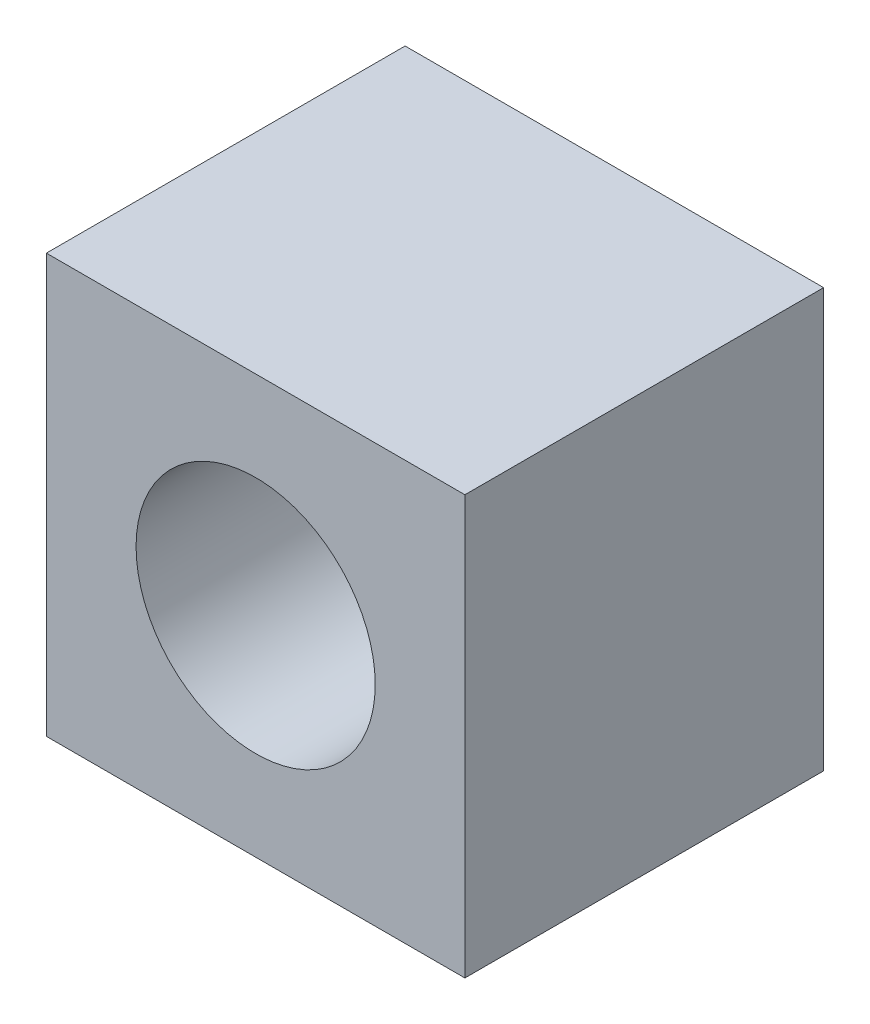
from build123d import *

# Parameters (mm, degrees)
SKETCH1_W           = 22.225
SKETCH1_H           = 22.225
SKETCH1_R           = 6.35
BOSS_EXTRUDE1_DEPTH = 19.05


with BuildPart() as part:
    # Sketch1 → Boss-Extrude1 (new body)
    with BuildSketch(Plane(origin=(0, 0, 0), x_dir=(0, 1, 0), z_dir=(0, 0, 1))):
        Rectangle(SKETCH1_W, SKETCH1_H)
        with Locations(Location((0, 0, 0), (0, 0, 90))):
            Circle(SKETCH1_R, mode=Mode.SUBTRACT)
    extrude(amount=BOSS_EXTRUDE1_DEPTH)


solid = part.part
